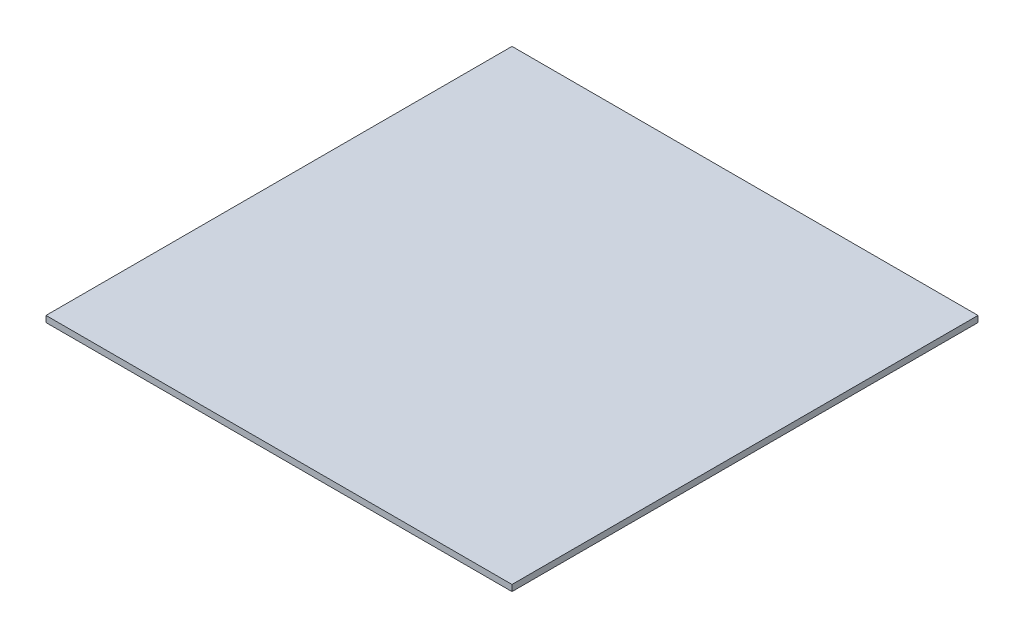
ISO-10303-21;
HEADER;
FILE_DESCRIPTION(('STEP AP214'),'2;1');
FILE_NAME('part.step','',(''),(''),'','','');
FILE_SCHEMA(('AUTOMOTIVE_DESIGN { 1 0 10303 214 1 1 1 1 }'));
ENDSEC;
DATA;
#1=APPLICATION_CONTEXT('core data for automotive mechanical design processes');
#2=APPLICATION_PROTOCOL_DEFINITION('international standard','automotive_design',2000,#1);
#3=PRODUCT_CONTEXT('',#1,'mechanical');
#4=PRODUCT('Part','Part','',(#3));
#5=PRODUCT_RELATED_PRODUCT_CATEGORY('part','',(#4));
#6=PRODUCT_DEFINITION_FORMATION('','',#4);
#7=PRODUCT_DEFINITION_CONTEXT('part definition',#1,'design');
#8=PRODUCT_DEFINITION('design','',#6,#7);
#9=PRODUCT_DEFINITION_SHAPE('','',#8);
#10=(LENGTH_UNIT() NAMED_UNIT(*) SI_UNIT(.MILLI.,.METRE.));
#11=(NAMED_UNIT(*) PLANE_ANGLE_UNIT() SI_UNIT($,.RADIAN.));
#12=(NAMED_UNIT(*) SI_UNIT($,.STERADIAN.) SOLID_ANGLE_UNIT());
#13=UNCERTAINTY_MEASURE_WITH_UNIT(LENGTH_MEASURE(1.E-05),#10,'distance_accuracy_value','');
#14=(GEOMETRIC_REPRESENTATION_CONTEXT(3) GLOBAL_UNCERTAINTY_ASSIGNED_CONTEXT((#13)) GLOBAL_UNIT_ASSIGNED_CONTEXT((#10,
#11,#12)) REPRESENTATION_CONTEXT('',''));
#15=CARTESIAN_POINT('',(0.,0.,0.));
#16=DIRECTION('',(0.,0.,1.));
#17=DIRECTION('',(1.,0.,0.));
#18=AXIS2_PLACEMENT_3D('',#15,#16,#17);
#19=CARTESIAN_POINT('',(0.,0.254,0.));
#20=DIRECTION('',(1.,0.,0.));
#21=DIRECTION('',(0.,0.,-1.));
#22=AXIS2_PLACEMENT_3D('',#19,#20,#21);
#23=PLANE('',#22);
#24=DIRECTION('',(0.,0.,1.));
#25=VECTOR('',#24,1.);
#26=CARTESIAN_POINT('',(0.,0.,0.));
#27=LINE('',#26,#25);
#28=CARTESIAN_POINT('',(0.,0.,-19.05));
#29=VERTEX_POINT('',#28);
#30=CARTESIAN_POINT('',(0.,0.,0.));
#31=VERTEX_POINT('',#30);
#32=EDGE_CURVE('E104',#29,#31,#27,.T.);
#33=ORIENTED_EDGE('',*,*,#32,.T.);
#34=DIRECTION('',(0.,-1.,0.));
#35=VECTOR('',#34,1.);
#36=CARTESIAN_POINT('',(0.,0.254,0.));
#37=LINE('',#36,#35);
#38=CARTESIAN_POINT('',(0.,0.254,0.));
#39=VERTEX_POINT('',#38);
#40=EDGE_CURVE('E11',#39,#31,#37,.T.);
#41=ORIENTED_EDGE('',*,*,#40,.F.);
#42=DIRECTION('',(0.,0.,1.));
#43=VECTOR('',#42,1.);
#44=CARTESIAN_POINT('',(0.,0.254,0.));
#45=LINE('',#44,#43);
#46=CARTESIAN_POINT('',(0.,0.254,-19.05));
#47=VERTEX_POINT('',#46);
#48=EDGE_CURVE('E92',#47,#39,#45,.T.);
#49=ORIENTED_EDGE('',*,*,#48,.F.);
#50=DIRECTION('',(0.,-1.,0.));
#51=VECTOR('',#50,1.);
#52=CARTESIAN_POINT('',(0.,0.254,-19.05));
#53=LINE('',#52,#51);
#54=EDGE_CURVE('E100',#47,#29,#53,.T.);
#55=ORIENTED_EDGE('',*,*,#54,.T.);
#56=EDGE_LOOP('',(#33,#41,#49,#55));
#57=FACE_BOUND('',#56,.T.);
#58=ADVANCED_FACE('F41',(#57),#23,.F.);
#59=CARTESIAN_POINT('',(0.,0.254,0.));
#60=DIRECTION('',(0.,0.,-1.));
#61=DIRECTION('',(-1.,0.,0.));
#62=AXIS2_PLACEMENT_3D('',#59,#60,#61);
#63=PLANE('',#62);
#64=DIRECTION('',(1.,0.,0.));
#65=VECTOR('',#64,1.);
#66=CARTESIAN_POINT('',(0.,0.,0.));
#67=LINE('',#66,#65);
#68=CARTESIAN_POINT('',(19.05,0.,0.));
#69=VERTEX_POINT('',#68);
#70=EDGE_CURVE('E96',#31,#69,#67,.T.);
#71=ORIENTED_EDGE('',*,*,#70,.T.);
#72=DIRECTION('',(0.,-1.,0.));
#73=VECTOR('',#72,1.);
#74=CARTESIAN_POINT('',(19.05,0.254,0.));
#75=LINE('',#74,#73);
#76=CARTESIAN_POINT('',(19.05,0.254,0.));
#77=VERTEX_POINT('',#76);
#78=EDGE_CURVE('E49',#77,#69,#75,.T.);
#79=ORIENTED_EDGE('',*,*,#78,.F.);
#80=DIRECTION('',(1.,0.,0.));
#81=VECTOR('',#80,1.);
#82=CARTESIAN_POINT('',(0.,0.254,0.));
#83=LINE('',#82,#81);
#84=EDGE_CURVE('E87',#39,#77,#83,.T.);
#85=ORIENTED_EDGE('',*,*,#84,.F.);
#86=ORIENTED_EDGE('',*,*,#40,.T.);
#87=EDGE_LOOP('',(#71,#79,#85,#86));
#88=FACE_BOUND('',#87,.T.);
#89=ADVANCED_FACE('F95',(#88),#63,.F.);
#90=CARTESIAN_POINT('',(19.05,0.254,0.));
#91=DIRECTION('',(-1.,0.,0.));
#92=DIRECTION('',(0.,0.,1.));
#93=AXIS2_PLACEMENT_3D('',#90,#91,#92);
#94=PLANE('',#93);
#95=DIRECTION('',(0.,0.,-1.));
#96=VECTOR('',#95,1.);
#97=CARTESIAN_POINT('',(19.05,0.,0.));
#98=LINE('',#97,#96);
#99=CARTESIAN_POINT('',(19.05,0.,-19.05));
#100=VERTEX_POINT('',#99);
#101=EDGE_CURVE('E74',#69,#100,#98,.T.);
#102=ORIENTED_EDGE('',*,*,#101,.T.);
#103=DIRECTION('',(0.,-1.,0.));
#104=VECTOR('',#103,1.);
#105=CARTESIAN_POINT('',(19.05,0.254,-19.05));
#106=LINE('',#105,#104);
#107=CARTESIAN_POINT('',(19.05,0.254,-19.05));
#108=VERTEX_POINT('',#107);
#109=EDGE_CURVE('E97',#108,#100,#106,.T.);
#110=ORIENTED_EDGE('',*,*,#109,.F.);
#111=DIRECTION('',(0.,0.,-1.));
#112=VECTOR('',#111,1.);
#113=CARTESIAN_POINT('',(19.05,0.254,0.));
#114=LINE('',#113,#112);
#115=EDGE_CURVE('E90',#77,#108,#114,.T.);
#116=ORIENTED_EDGE('',*,*,#115,.F.);
#117=ORIENTED_EDGE('',*,*,#78,.T.);
#118=EDGE_LOOP('',(#102,#110,#116,#117));
#119=FACE_BOUND('',#118,.T.);
#120=ADVANCED_FACE('F98',(#119),#94,.F.);
#121=CARTESIAN_POINT('',(0.,0.254,-19.05));
#122=DIRECTION('',(0.,0.,1.));
#123=DIRECTION('',(1.,0.,0.));
#124=AXIS2_PLACEMENT_3D('',#121,#122,#123);
#125=PLANE('',#124);
#126=DIRECTION('',(-1.,0.,0.));
#127=VECTOR('',#126,1.);
#128=CARTESIAN_POINT('',(0.,0.,-19.05));
#129=LINE('',#128,#127);
#130=EDGE_CURVE('E80',#100,#29,#129,.T.);
#131=ORIENTED_EDGE('',*,*,#130,.T.);
#132=ORIENTED_EDGE('',*,*,#54,.F.);
#133=DIRECTION('',(-1.,0.,0.));
#134=VECTOR('',#133,1.);
#135=CARTESIAN_POINT('',(0.,0.254,-19.05));
#136=LINE('',#135,#134);
#137=EDGE_CURVE('E57',#108,#47,#136,.T.);
#138=ORIENTED_EDGE('',*,*,#137,.F.);
#139=ORIENTED_EDGE('',*,*,#109,.T.);
#140=EDGE_LOOP('',(#131,#132,#138,#139));
#141=FACE_BOUND('',#140,.T.);
#142=ADVANCED_FACE('F111',(#141),#125,.F.);
#143=CARTESIAN_POINT('',(0.,0.254,0.));
#144=DIRECTION('',(0.,-1.,0.));
#145=DIRECTION('',(0.,0.,-1.));
#146=AXIS2_PLACEMENT_3D('',#143,#144,#145);
#147=PLANE('',#146);
#148=ORIENTED_EDGE('',*,*,#48,.T.);
#149=ORIENTED_EDGE('',*,*,#84,.T.);
#150=ORIENTED_EDGE('',*,*,#115,.T.);
#151=ORIENTED_EDGE('',*,*,#137,.T.);
#152=EDGE_LOOP('',(#148,#149,#150,#151));
#153=FACE_BOUND('',#152,.T.);
#154=ADVANCED_FACE('F88',(#153),#147,.F.);
#155=CARTESIAN_POINT('',(0.,0.,0.));
#156=DIRECTION('',(0.,-1.,0.));
#157=DIRECTION('',(0.,0.,-1.));
#158=AXIS2_PLACEMENT_3D('',#155,#156,#157);
#159=PLANE('',#158);
#160=ORIENTED_EDGE('',*,*,#32,.F.);
#161=ORIENTED_EDGE('',*,*,#130,.F.);
#162=ORIENTED_EDGE('',*,*,#101,.F.);
#163=ORIENTED_EDGE('',*,*,#70,.F.);
#164=EDGE_LOOP('',(#160,#161,#162,#163));
#165=FACE_BOUND('',#164,.T.);
#166=ADVANCED_FACE('F114',(#165),#159,.T.);
#167=CLOSED_SHELL('',(#58,#89,#120,#142,#154,#166));
#168=MANIFOLD_SOLID_BREP('B2',#167);
#169=ADVANCED_BREP_SHAPE_REPRESENTATION('',(#18,#168),#14);
#170=SHAPE_DEFINITION_REPRESENTATION(#9,#169);
ENDSEC;
END-ISO-10303-21;
